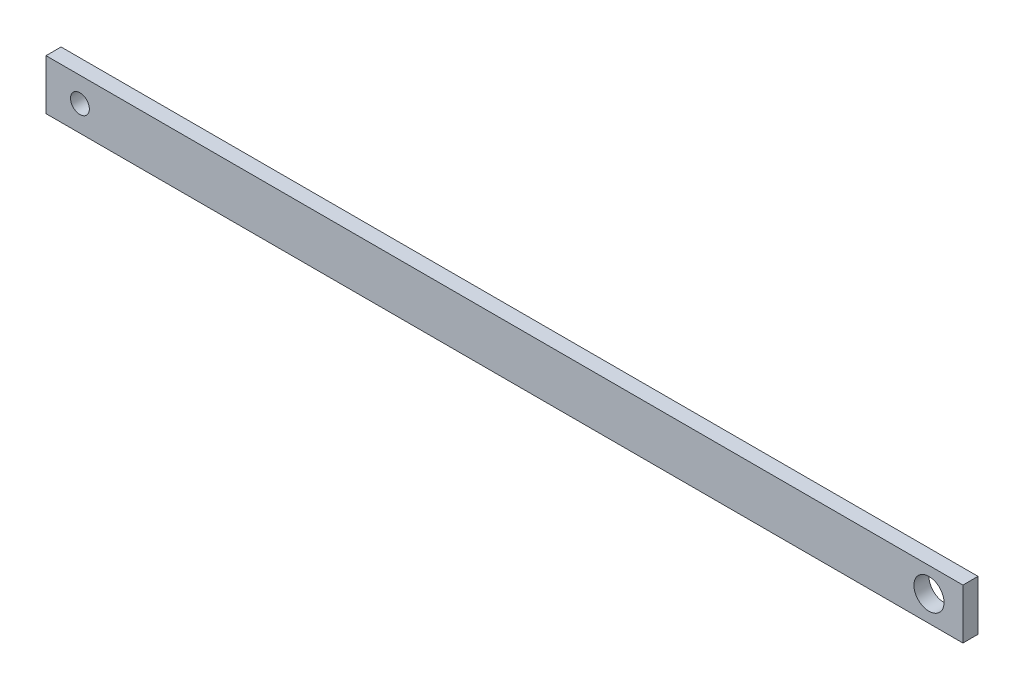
from build123d import *

# Parameters (mm, degrees)
SKETCH1_W           = 146
SKETCH1_H           = 8
BOSS_EXTRUDE1_DEPTH = 2.4
SKETCH2_R           = 1.5
SKETCH2_R_2         = 2.4
CUT_EXTRUDE1_DEPTH  = 2.4


with BuildPart() as part:
    # Sketch1 → Boss-Extrude1 (new body)
    with BuildSketch(Plane.XY):
        with Locations((73, 4)):
            Rectangle(SKETCH1_W, SKETCH1_H)
    extrude(amount=BOSS_EXTRUDE1_DEPTH)

    # Sketch2 → Cut-Extrude1 (cut)
    with BuildSketch(Plane.XY.offset(2.4)):
        with Locations((5.405, 4.081274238)):
            Circle(SKETCH2_R)
        with Locations((140.595, 4.081274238)):
            Circle(SKETCH2_R_2)
    extrude(amount=-CUT_EXTRUDE1_DEPTH, mode=Mode.SUBTRACT)


solid = part.part
